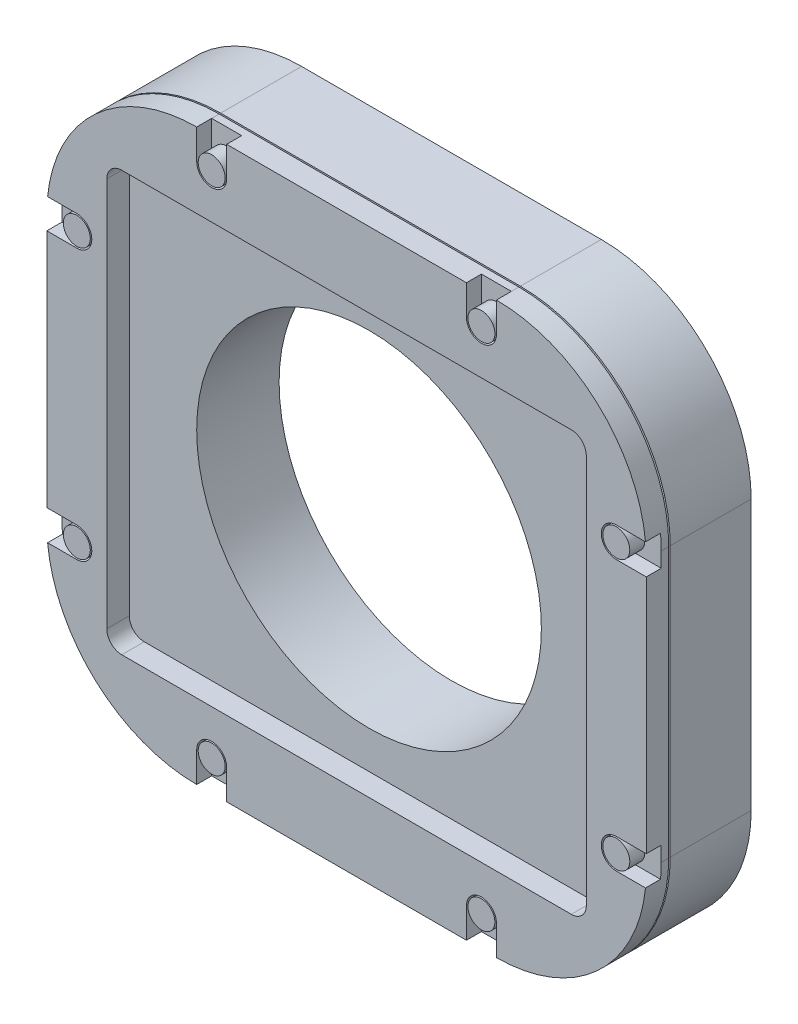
from build123d import *

# Parameters (mm, degrees)
ESQUISSE1_R             = 11.5
EXTRUSION1_DEPTH        = 7
ENL_V_MAT_EXTRU_1_DEPTH = 1.5
ENL_V_START             = -1
ENL_V_MAT_EXTRU_2_DEPTH = 1
ENL_V_START_2           = -0.1
ENL_V_MAT_EXTRU_3_DEPTH = 0.1
ESQUISSE5_R             = 0.9
EXTRUSION2_DEPTH        = 1


with BuildPart() as part:
    # Esquisse1 → Extrusion1 (new body)
    with BuildSketch(Plane.XY):
        with BuildLine():
            Line((-10, 19), (10, 19))
            ThreePointArc((10, 19), (17.071067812, 16.071067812), (20, 9))
            Line((20, 9), (20, -9))
            ThreePointArc((20, -9), (17.071067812, -16.071067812), (10, -19))
            Line((10, -19), (-10, -19))
            ThreePointArc((-10, -19), (-17.071067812, -16.071067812), (-20, -9))
            Line((-20, -9), (-20, 9))
            ThreePointArc((-20, 9), (-17.071067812, 16.071067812), (-10, 19))
        make_face()
        Circle(ESQUISSE1_R, mode=Mode.SUBTRACT)
    extrude(amount=EXTRUSION1_DEPTH)

    # Esquisse2 → Enl_v. mat.-Extru.1 (cut)
    with BuildSketch(Plane.XY.offset(7)):
        with BuildLine():
            Line((-15, 14), (15, 14))
            ThreePointArc((15, 14), (15.707106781, 13.707106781), (16, 13))
            Line((16, 13), (16, -13))
            ThreePointArc((16, -13), (15.707106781, -13.707106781), (15, -14))
            Line((15, -14), (-15, -14))
            ThreePointArc((-15, -14), (-15.707106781, -13.707106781), (-16, -13))
            Line((-16, -13), (-16, 13))
            ThreePointArc((-16, 13), (-15.707106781, 13.707106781), (-15, 14))
        make_face()
    extrude(amount=-ENL_V_MAT_EXTRU_1_DEPTH, mode=Mode.SUBTRACT)

    # Esquisse3 → Enl_v. mat.-Extru.2 (cut)
    with BuildSketch(Plane.XY.offset(7).offset(ENL_V_START)):
        with BuildLine():
            Line((10, 19), (8, 19))
            Line((8, 19), (8, 17))
            ThreePointArc((8, 17), (9, 16), (10, 17))
            Line((10, 17), (10, 19))
        make_face()
        with BuildLine():
            Line((20, 8), (20, 9))
            ThreePointArc((20, 9), (19.987460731, 9.500627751), (19.949874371, 10))
            Line((19.949874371, 10), (18, 10))
            ThreePointArc((18, 10), (17, 9), (18, 8))
            Line((18, 8), (20, 8))
        make_face()
        with BuildLine():
            Line((-18, 10), (-19.949874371, 10))
            ThreePointArc((-19.949874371, 10), (-19.987460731, 9.500627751), (-20, 9))
            Line((-20, 9), (-20, 8))
            Line((-20, 8), (-18, 8))
            ThreePointArc((-18, 8), (-17, 9), (-18, 10))
        make_face()
        with BuildLine():
            Line((-8, 17), (-8, 19))
            Line((-8, 19), (-10, 19))
            Line((-10, 19), (-10, 17))
            ThreePointArc((-10, 17), (-9, 16), (-8, 17))
        make_face()
        with BuildLine():
            Line((-10, -19), (-8, -19))
            Line((-8, -19), (-8, -17))
            ThreePointArc((-8, -17), (-9, -16), (-10, -17))
            Line((-10, -17), (-10, -19))
        make_face()
        with BuildLine():
            Line((-20, -8), (-20, -9))
            ThreePointArc((-20, -9), (-19.987460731, -9.500627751), (-19.949874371, -10))
            Line((-19.949874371, -10), (-18, -10))
            ThreePointArc((-18, -10), (-17, -9), (-18, -8))
            Line((-18, -8), (-20, -8))
        make_face()
        with BuildLine():
            Line((18, -10), (19.949874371, -10))
            ThreePointArc((19.949874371, -10), (19.987460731, -9.500627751), (20, -9))
            Line((20, -9), (20, -8))
            Line((20, -8), (18, -8))
            ThreePointArc((18, -8), (17, -9), (18, -10))
        make_face()
        with BuildLine():
            Line((8, -17), (8, -19))
            Line((8, -19), (10, -19))
            Line((10, -19), (10, -17))
            ThreePointArc((10, -17), (9, -16), (8, -17))
        make_face()
    extrude(amount=ENL_V_MAT_EXTRU_2_DEPTH, mode=Mode.SUBTRACT)

    # Esquisse4 → Enl_v. mat.-Extru.3 (cut)
    with BuildSketch(Plane.XY.offset(5.5).offset(ENL_V_START_2)):
        with BuildLine():
            Line((20, 8), (20, 9))
            ThreePointArc((20, 9), (19.987460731, 9.500627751), (19.949874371, 10))
            ThreePointArc((19.949874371, 10), (16.708203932, 16.416198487), (10, 19))
            Line((10, 19), (8, 19))
            Line((8, 19), (-8, 19))
            Line((-8, 19), (-10, 19))
            ThreePointArc((-10, 19), (-16.708203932, 16.416198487), (-19.949874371, 10))
            ThreePointArc((-19.949874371, 10), (-19.987460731, 9.500627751), (-20, 9))
            Line((-20, 9), (-20, 8))
            Line((-20, 8), (-20, -8))
            Line((-20, -8), (-20, -9))
            ThreePointArc((-20, -9), (-19.987460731, -9.500627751), (-19.949874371, -10))
            ThreePointArc((-19.949874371, -10), (-16.708203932, -16.416198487), (-10, -19))
            Line((-10, -19), (-8, -19))
            Line((-8, -19), (8, -19))
            Line((8, -19), (10, -19))
            ThreePointArc((10, -19), (16.708203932, -16.416198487), (19.949874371, -10))
            ThreePointArc((19.949874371, -10), (19.987460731, -9.500627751), (20, -9))
            Line((20, -9), (20, -8))
            Line((20, -8), (20, 8))
        make_face()
        with BuildLine():
            Line((8, 18.5), (-8, 18.5))
            Line((-8, 18.5), (-10, 18.5))
            ThreePointArc((-10, 18.5), (-16.372793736, 16.045388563), (-19.452380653, 9.95))
            ThreePointArc((-19.452380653, 9.95), (-19.488087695, 9.475596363), (-19.5, 9))
            Line((-19.5, 9), (-19.5, 8))
            Line((-19.5, 8), (-19.5, -8))
            Line((-19.5, -8), (-19.5, -9))
            ThreePointArc((-19.5, -9), (-19.488087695, -9.475596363), (-19.452380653, -9.95))
            ThreePointArc((-19.452380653, -9.95), (-16.372793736, -16.045388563), (-10, -18.5))
            Line((-10, -18.5), (-8, -18.5))
            Line((-8, -18.5), (8, -18.5))
            Line((8, -18.5), (10, -18.5))
            ThreePointArc((10, -18.5), (16.372793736, -16.045388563), (19.452380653, -9.95))
            ThreePointArc((19.452380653, -9.95), (19.488087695, -9.475596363), (19.5, -9))
            Line((19.5, -9), (19.5, -8))
            Line((19.5, -8), (19.5, 8))
            Line((19.5, 8), (19.5, 9))
            ThreePointArc((19.5, 9), (19.488087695, 9.475596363), (19.452380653, 9.95))
            ThreePointArc((19.452380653, 9.95), (16.372793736, 16.045388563), (10, 18.5))
            Line((10, 18.5), (8, 18.5))
        make_face(mode=Mode.SUBTRACT)
    extrude(amount=ENL_V_MAT_EXTRU_3_DEPTH, mode=Mode.SUBTRACT)

    # Esquisse5 → Extrusion2 (add)
    with BuildSketch(Plane.XY.offset(6)):
        with Locations((9, 17)):
            Circle(ESQUISSE5_R)
        with Locations((18, 9)):
            Circle(ESQUISSE5_R)
        with Locations(Location((-18, 9, 0), (0, 0, 180))):
            Circle(ESQUISSE5_R)
        with Locations(Location((-9, 17, 0), (0, 0, 180))):
            Circle(ESQUISSE5_R)
        with Locations((-9, -17)):
            Circle(ESQUISSE5_R)
        with Locations((-18, -9)):
            Circle(ESQUISSE5_R)
        with Locations(Location((18, -9, 0), (0, 0, 180))):
            Circle(ESQUISSE5_R)
        with Locations(Location((9, -17, 0), (0, 0, 180))):
            Circle(ESQUISSE5_R)
    extrude(amount=EXTRUSION2_DEPTH)


solid = part.part
